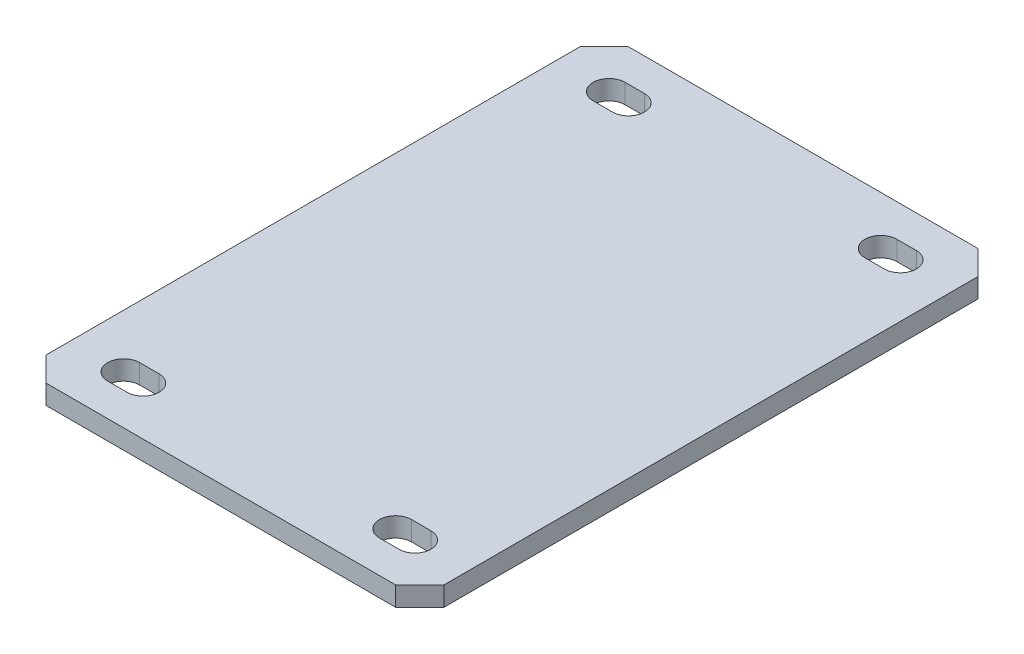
ISO-10303-21;
HEADER;
FILE_DESCRIPTION(('STEP AP214'),'2;1');
FILE_NAME('part.step','',(''),(''),'','','');
FILE_SCHEMA(('AUTOMOTIVE_DESIGN { 1 0 10303 214 1 1 1 1 }'));
ENDSEC;
DATA;
#1=APPLICATION_CONTEXT('core data for automotive mechanical design processes');
#2=APPLICATION_PROTOCOL_DEFINITION('international standard','automotive_design',2000,#1);
#3=PRODUCT_CONTEXT('',#1,'mechanical');
#4=PRODUCT('Part','Part','',(#3));
#5=PRODUCT_RELATED_PRODUCT_CATEGORY('part','',(#4));
#6=PRODUCT_DEFINITION_FORMATION('','',#4);
#7=PRODUCT_DEFINITION_CONTEXT('part definition',#1,'design');
#8=PRODUCT_DEFINITION('design','',#6,#7);
#9=PRODUCT_DEFINITION_SHAPE('','',#8);
#10=(LENGTH_UNIT() NAMED_UNIT(*) SI_UNIT(.MILLI.,.METRE.));
#11=(NAMED_UNIT(*) PLANE_ANGLE_UNIT() SI_UNIT($,.RADIAN.));
#12=(NAMED_UNIT(*) SI_UNIT($,.STERADIAN.) SOLID_ANGLE_UNIT());
#13=UNCERTAINTY_MEASURE_WITH_UNIT(LENGTH_MEASURE(1.E-05),#10,'distance_accuracy_value','');
#14=(GEOMETRIC_REPRESENTATION_CONTEXT(3) GLOBAL_UNCERTAINTY_ASSIGNED_CONTEXT((#13)) GLOBAL_UNIT_ASSIGNED_CONTEXT((#10,
#11,#12)) REPRESENTATION_CONTEXT('',''));
#15=CARTESIAN_POINT('',(0.,0.,0.));
#16=DIRECTION('',(0.,0.,1.));
#17=DIRECTION('',(1.,0.,0.));
#18=AXIS2_PLACEMENT_3D('',#15,#16,#17);
#19=CARTESIAN_POINT('',(-75.,4.,-60.));
#20=DIRECTION('',(0.,0.,1.));
#21=DIRECTION('',(1.,0.,0.));
#22=AXIS2_PLACEMENT_3D('',#19,#20,#21);
#23=PLANE('',#22);
#24=DIRECTION('',(-1.,0.,0.));
#25=VECTOR('',#24,1.);
#26=CARTESIAN_POINT('',(-75.,4.,-60.));
#27=LINE('',#26,#25);
#28=CARTESIAN_POINT('',(9.00000000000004,4.,-60.));
#29=VERTEX_POINT('',#28);
#30=CARTESIAN_POINT('',(-63.,4.,-60.));
#31=VERTEX_POINT('',#30);
#32=EDGE_CURVE('E342',#29,#31,#27,.T.);
#33=ORIENTED_EDGE('',*,*,#32,.F.);
#34=DIRECTION('',(0.,-1.,0.));
#35=VECTOR('',#34,1.);
#36=CARTESIAN_POINT('',(9.00000000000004,4.,-60.));
#37=LINE('',#36,#35);
#38=CARTESIAN_POINT('',(9.00000000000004,0.,-60.));
#39=VERTEX_POINT('',#38);
#40=EDGE_CURVE('E355',#29,#39,#37,.T.);
#41=ORIENTED_EDGE('',*,*,#40,.T.);
#42=DIRECTION('',(-1.,0.,0.));
#43=VECTOR('',#42,1.);
#44=CARTESIAN_POINT('',(-75.,0.,-60.));
#45=LINE('',#44,#43);
#46=CARTESIAN_POINT('',(-63.,0.,-60.));
#47=VERTEX_POINT('',#46);
#48=EDGE_CURVE('E335',#39,#47,#45,.T.);
#49=ORIENTED_EDGE('',*,*,#48,.T.);
#50=DIRECTION('',(0.,1.,0.));
#51=VECTOR('',#50,1.);
#52=CARTESIAN_POINT('',(-63.,4.,-60.));
#53=LINE('',#52,#51);
#54=EDGE_CURVE('E348',#47,#31,#53,.T.);
#55=ORIENTED_EDGE('',*,*,#54,.T.);
#56=EDGE_LOOP('',(#33,#41,#49,#55));
#57=FACE_BOUND('',#56,.T.);
#58=ADVANCED_FACE('F36',(#57),#23,.F.);
#59=CARTESIAN_POINT('',(-75.,4.,60.));
#60=DIRECTION('',(0.,0.,-1.));
#61=DIRECTION('',(-1.,0.,0.));
#62=AXIS2_PLACEMENT_3D('',#59,#60,#61);
#63=PLANE('',#62);
#64=DIRECTION('',(1.,0.,0.));
#65=VECTOR('',#64,1.);
#66=CARTESIAN_POINT('',(-75.,0.,60.));
#67=LINE('',#66,#65);
#68=CARTESIAN_POINT('',(-63.,0.,60.));
#69=VERTEX_POINT('',#68);
#70=CARTESIAN_POINT('',(9.00000000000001,0.,60.));
#71=VERTEX_POINT('',#70);
#72=EDGE_CURVE('E345',#69,#71,#67,.T.);
#73=ORIENTED_EDGE('',*,*,#72,.T.);
#74=DIRECTION('',(0.,1.,0.));
#75=VECTOR('',#74,1.);
#76=CARTESIAN_POINT('',(9.00000000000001,4.,60.));
#77=LINE('',#76,#75);
#78=CARTESIAN_POINT('',(9.00000000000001,4.,60.));
#79=VERTEX_POINT('',#78);
#80=EDGE_CURVE('E379',#71,#79,#77,.T.);
#81=ORIENTED_EDGE('',*,*,#80,.T.);
#82=DIRECTION('',(1.,0.,0.));
#83=VECTOR('',#82,1.);
#84=CARTESIAN_POINT('',(-75.,4.,60.));
#85=LINE('',#84,#83);
#86=CARTESIAN_POINT('',(-63.,4.,60.));
#87=VERTEX_POINT('',#86);
#88=EDGE_CURVE('E344',#87,#79,#85,.T.);
#89=ORIENTED_EDGE('',*,*,#88,.F.);
#90=DIRECTION('',(0.,-1.,0.));
#91=VECTOR('',#90,1.);
#92=CARTESIAN_POINT('',(-63.,4.,60.));
#93=LINE('',#92,#91);
#94=EDGE_CURVE('E377',#87,#69,#93,.T.);
#95=ORIENTED_EDGE('',*,*,#94,.T.);
#96=EDGE_LOOP('',(#73,#81,#89,#95));
#97=FACE_BOUND('',#96,.T.);
#98=ADVANCED_FACE('F414',(#97),#63,.F.);
#99=CARTESIAN_POINT('',(0.,4.,0.));
#100=DIRECTION('',(0.,-1.,0.));
#101=DIRECTION('',(0.,0.,-1.));
#102=AXIS2_PLACEMENT_3D('',#99,#100,#101);
#103=PLANE('',#102);
#104=DIRECTION('',(1.,0.,0.));
#105=VECTOR('',#104,1.);
#106=CARTESIAN_POINT('',(-57.,4.,53.3));
#107=LINE('',#106,#105);
#108=CARTESIAN_POINT('',(-57.,4.,53.3));
#109=VERTEX_POINT('',#108);
#110=CARTESIAN_POINT('',(-53.,4.,53.3));
#111=VERTEX_POINT('',#110);
#112=EDGE_CURVE('E235',#109,#111,#107,.T.);
#113=ORIENTED_EDGE('',*,*,#112,.F.);
#114=CARTESIAN_POINT('',(-57.,4.,50.));
#115=DIRECTION('',(0.,1.,0.));
#116=DIRECTION('',(0.,0.,1.));
#117=AXIS2_PLACEMENT_3D('',#114,#115,#116);
#118=CIRCLE('',#117,3.3);
#119=CARTESIAN_POINT('',(-57.,4.,46.7));
#120=VERTEX_POINT('',#119);
#121=EDGE_CURVE('E205',#120,#109,#118,.T.);
#122=ORIENTED_EDGE('',*,*,#121,.F.);
#123=DIRECTION('',(-1.,0.,0.));
#124=VECTOR('',#123,1.);
#125=CARTESIAN_POINT('',(-57.,4.,46.7));
#126=LINE('',#125,#124);
#127=CARTESIAN_POINT('',(-53.,4.,46.7));
#128=VERTEX_POINT('',#127);
#129=EDGE_CURVE('E223',#128,#120,#126,.T.);
#130=ORIENTED_EDGE('',*,*,#129,.F.);
#131=CARTESIAN_POINT('',(-53.,4.,50.));
#132=DIRECTION('',(0.,1.,0.));
#133=DIRECTION('',(0.,0.,1.));
#134=AXIS2_PLACEMENT_3D('',#131,#132,#133);
#135=CIRCLE('',#134,3.3);
#136=EDGE_CURVE('E226',#111,#128,#135,.T.);
#137=ORIENTED_EDGE('',*,*,#136,.F.);
#138=EDGE_LOOP('',(#113,#122,#130,#137));
#139=FACE_BOUND('',#138,.T.);
#140=DIRECTION('',(1.,0.,0.));
#141=VECTOR('',#140,1.);
#142=CARTESIAN_POINT('',(-0.999999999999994,4.,53.3));
#143=LINE('',#142,#141);
#144=CARTESIAN_POINT('',(-0.999999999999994,4.,53.3));
#145=VERTEX_POINT('',#144);
#146=CARTESIAN_POINT('',(3.00000000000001,4.,53.3));
#147=VERTEX_POINT('',#146);
#148=EDGE_CURVE('E262',#145,#147,#143,.T.);
#149=ORIENTED_EDGE('',*,*,#148,.F.);
#150=CARTESIAN_POINT('',(-0.999999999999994,4.,50.));
#151=DIRECTION('',(0.,1.,0.));
#152=DIRECTION('',(0.,0.,1.));
#153=AXIS2_PLACEMENT_3D('',#150,#151,#152);
#154=CIRCLE('',#153,3.3);
#155=CARTESIAN_POINT('',(-0.999999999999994,4.,46.7));
#156=VERTEX_POINT('',#155);
#157=EDGE_CURVE('E260',#156,#145,#154,.T.);
#158=ORIENTED_EDGE('',*,*,#157,.F.);
#159=DIRECTION('',(-1.,0.,0.));
#160=VECTOR('',#159,1.);
#161=CARTESIAN_POINT('',(-0.999999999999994,4.,46.7));
#162=LINE('',#161,#160);
#163=CARTESIAN_POINT('',(3.00000000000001,4.,46.7));
#164=VERTEX_POINT('',#163);
#165=EDGE_CURVE('E250',#164,#156,#162,.T.);
#166=ORIENTED_EDGE('',*,*,#165,.F.);
#167=CARTESIAN_POINT('',(3.00000000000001,4.,50.));
#168=DIRECTION('',(0.,1.,0.));
#169=DIRECTION('',(0.,0.,1.));
#170=AXIS2_PLACEMENT_3D('',#167,#168,#169);
#171=CIRCLE('',#170,3.3);
#172=EDGE_CURVE('E266',#147,#164,#171,.T.);
#173=ORIENTED_EDGE('',*,*,#172,.F.);
#174=EDGE_LOOP('',(#149,#158,#166,#173));
#175=FACE_BOUND('',#174,.T.);
#176=DIRECTION('',(1.,0.,0.));
#177=VECTOR('',#176,1.);
#178=CARTESIAN_POINT('',(-0.999999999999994,4.,-46.7));
#179=LINE('',#178,#177);
#180=CARTESIAN_POINT('',(-0.999999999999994,4.,-46.7));
#181=VERTEX_POINT('',#180);
#182=CARTESIAN_POINT('',(3.00000000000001,4.,-46.7));
#183=VERTEX_POINT('',#182);
#184=EDGE_CURVE('E294',#181,#183,#179,.T.);
#185=ORIENTED_EDGE('',*,*,#184,.F.);
#186=CARTESIAN_POINT('',(-0.999999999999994,4.,-50.));
#187=DIRECTION('',(0.,1.,0.));
#188=DIRECTION('',(0.,0.,1.));
#189=AXIS2_PLACEMENT_3D('',#186,#187,#188);
#190=CIRCLE('',#189,3.3);
#191=CARTESIAN_POINT('',(-0.999999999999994,4.,-53.3));
#192=VERTEX_POINT('',#191);
#193=EDGE_CURVE('E292',#192,#181,#190,.T.);
#194=ORIENTED_EDGE('',*,*,#193,.F.);
#195=DIRECTION('',(-1.,0.,0.));
#196=VECTOR('',#195,1.);
#197=CARTESIAN_POINT('',(-0.999999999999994,4.,-53.3));
#198=LINE('',#197,#196);
#199=CARTESIAN_POINT('',(3.00000000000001,4.,-53.3));
#200=VERTEX_POINT('',#199);
#201=EDGE_CURVE('E282',#200,#192,#198,.T.);
#202=ORIENTED_EDGE('',*,*,#201,.F.);
#203=CARTESIAN_POINT('',(3.00000000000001,4.,-50.));
#204=DIRECTION('',(0.,1.,0.));
#205=DIRECTION('',(0.,0.,1.));
#206=AXIS2_PLACEMENT_3D('',#203,#204,#205);
#207=CIRCLE('',#206,3.3);
#208=EDGE_CURVE('E298',#183,#200,#207,.T.);
#209=ORIENTED_EDGE('',*,*,#208,.F.);
#210=EDGE_LOOP('',(#185,#194,#202,#209));
#211=FACE_BOUND('',#210,.T.);
#212=DIRECTION('',(1.,0.,0.));
#213=VECTOR('',#212,1.);
#214=CARTESIAN_POINT('',(-57.,4.,-46.7));
#215=LINE('',#214,#213);
#216=CARTESIAN_POINT('',(-57.,4.,-46.7));
#217=VERTEX_POINT('',#216);
#218=CARTESIAN_POINT('',(-53.,4.,-46.7));
#219=VERTEX_POINT('',#218);
#220=EDGE_CURVE('E325',#217,#219,#215,.T.);
#221=ORIENTED_EDGE('',*,*,#220,.F.);
#222=CARTESIAN_POINT('',(-57.,4.,-50.));
#223=DIRECTION('',(0.,1.,0.));
#224=DIRECTION('',(0.,0.,1.));
#225=AXIS2_PLACEMENT_3D('',#222,#223,#224);
#226=CIRCLE('',#225,3.3);
#227=CARTESIAN_POINT('',(-57.,4.,-53.3));
#228=VERTEX_POINT('',#227);
#229=EDGE_CURVE('E242',#228,#217,#226,.T.);
#230=ORIENTED_EDGE('',*,*,#229,.F.);
#231=DIRECTION('',(-1.,0.,0.));
#232=VECTOR('',#231,1.);
#233=CARTESIAN_POINT('',(-57.,4.,-53.3));
#234=LINE('',#233,#232);
#235=CARTESIAN_POINT('',(-53.,4.,-53.3));
#236=VERTEX_POINT('',#235);
#237=EDGE_CURVE('E314',#236,#228,#234,.T.);
#238=ORIENTED_EDGE('',*,*,#237,.F.);
#239=CARTESIAN_POINT('',(-53.,4.,-50.));
#240=DIRECTION('',(0.,1.,0.));
#241=DIRECTION('',(0.,0.,1.));
#242=AXIS2_PLACEMENT_3D('',#239,#240,#241);
#243=CIRCLE('',#242,3.3);
#244=EDGE_CURVE('E328',#219,#236,#243,.T.);
#245=ORIENTED_EDGE('',*,*,#244,.F.);
#246=EDGE_LOOP('',(#221,#230,#238,#245));
#247=FACE_BOUND('',#246,.T.);
#248=DIRECTION('',(0.,0.,-1.));
#249=VECTOR('',#248,1.);
#250=CARTESIAN_POINT('',(14.,4.,60.));
#251=LINE('',#250,#249);
#252=CARTESIAN_POINT('',(14.,4.,55.));
#253=VERTEX_POINT('',#252);
#254=CARTESIAN_POINT('',(14.,4.,-55.));
#255=VERTEX_POINT('',#254);
#256=EDGE_CURVE('E389',#253,#255,#251,.T.);
#257=ORIENTED_EDGE('',*,*,#256,.T.);
#258=DIRECTION('',(0.707106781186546,0.,0.707106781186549));
#259=VECTOR('',#258,1.);
#260=CARTESIAN_POINT('',(9.00000000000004,4.,-60.));
#261=LINE('',#260,#259);
#262=EDGE_CURVE('E375',#255,#29,#261,.F.);
#263=ORIENTED_EDGE('',*,*,#262,.T.);
#264=ORIENTED_EDGE('',*,*,#32,.T.);
#265=DIRECTION('',(0.707106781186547,0.,-0.707106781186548));
#266=VECTOR('',#265,1.);
#267=CARTESIAN_POINT('',(-63.,4.,-60.));
#268=LINE('',#267,#266);
#269=CARTESIAN_POINT('',(-68.,4.,-55.));
#270=VERTEX_POINT('',#269);
#271=EDGE_CURVE('E51',#31,#270,#268,.F.);
#272=ORIENTED_EDGE('',*,*,#271,.T.);
#273=DIRECTION('',(0.,0.,-1.));
#274=VECTOR('',#273,1.);
#275=CARTESIAN_POINT('',(-68.,4.,-60.));
#276=LINE('',#275,#274);
#277=CARTESIAN_POINT('',(-68.,4.,55.));
#278=VERTEX_POINT('',#277);
#279=EDGE_CURVE('E229',#278,#270,#276,.T.);
#280=ORIENTED_EDGE('',*,*,#279,.F.);
#281=DIRECTION('',(-0.70710678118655,0.,-0.707106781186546));
#282=VECTOR('',#281,1.);
#283=CARTESIAN_POINT('',(-68.,4.,55.));
#284=LINE('',#283,#282);
#285=EDGE_CURVE('E59',#278,#87,#284,.F.);
#286=ORIENTED_EDGE('',*,*,#285,.T.);
#287=ORIENTED_EDGE('',*,*,#88,.T.);
#288=DIRECTION('',(-0.70710678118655,0.,0.707106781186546));
#289=VECTOR('',#288,1.);
#290=CARTESIAN_POINT('',(14.,4.,55.));
#291=LINE('',#290,#289);
#292=EDGE_CURVE('E373',#79,#253,#291,.F.);
#293=ORIENTED_EDGE('',*,*,#292,.T.);
#294=EDGE_LOOP('',(#257,#263,#264,#272,#280,#286,#287,#293));
#295=FACE_BOUND('',#294,.T.);
#296=ADVANCED_FACE('F387',(#139,#175,#211,#247,#295),#103,.F.);
#297=CARTESIAN_POINT('',(0.,0.,0.));
#298=DIRECTION('',(0.,-1.,0.));
#299=DIRECTION('',(0.,0.,-1.));
#300=AXIS2_PLACEMENT_3D('',#297,#298,#299);
#301=PLANE('',#300);
#302=ORIENTED_EDGE('',*,*,#48,.F.);
#303=DIRECTION('',(-0.707106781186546,0.,-0.707106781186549));
#304=VECTOR('',#303,1.);
#305=CARTESIAN_POINT('',(34.5,0.,-34.4999999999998));
#306=LINE('',#305,#304);
#307=CARTESIAN_POINT('',(14.,0.,-55.));
#308=VERTEX_POINT('',#307);
#309=EDGE_CURVE('E364',#39,#308,#306,.F.);
#310=ORIENTED_EDGE('',*,*,#309,.T.);
#311=DIRECTION('',(0.,0.,-1.));
#312=VECTOR('',#311,1.);
#313=CARTESIAN_POINT('',(14.,0.,60.));
#314=LINE('',#313,#312);
#315=CARTESIAN_POINT('',(14.,0.,55.));
#316=VERTEX_POINT('',#315);
#317=EDGE_CURVE('E390',#316,#308,#314,.T.);
#318=ORIENTED_EDGE('',*,*,#317,.F.);
#319=DIRECTION('',(0.70710678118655,0.,-0.707106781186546));
#320=VECTOR('',#319,1.);
#321=CARTESIAN_POINT('',(34.5,0.,34.5000000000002));
#322=LINE('',#321,#320);
#323=EDGE_CURVE('E362',#316,#71,#322,.F.);
#324=ORIENTED_EDGE('',*,*,#323,.T.);
#325=ORIENTED_EDGE('',*,*,#72,.F.);
#326=DIRECTION('',(0.70710678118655,0.,0.707106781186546));
#327=VECTOR('',#326,1.);
#328=CARTESIAN_POINT('',(-61.4999999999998,0.,61.5000000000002));
#329=LINE('',#328,#327);
#330=CARTESIAN_POINT('',(-68.,0.,55.));
#331=VERTEX_POINT('',#330);
#332=EDGE_CURVE('E358',#69,#331,#329,.F.);
#333=ORIENTED_EDGE('',*,*,#332,.T.);
#334=DIRECTION('',(0.,0.,-1.));
#335=VECTOR('',#334,1.);
#336=CARTESIAN_POINT('',(-68.,0.,-60.));
#337=LINE('',#336,#335);
#338=CARTESIAN_POINT('',(-68.,0.,-55.));
#339=VERTEX_POINT('',#338);
#340=EDGE_CURVE('E295',#331,#339,#337,.T.);
#341=ORIENTED_EDGE('',*,*,#340,.T.);
#342=DIRECTION('',(-0.707106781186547,0.,0.707106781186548));
#343=VECTOR('',#342,1.);
#344=CARTESIAN_POINT('',(-61.5000000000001,0.,-61.4999999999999));
#345=LINE('',#344,#343);
#346=EDGE_CURVE('E360',#339,#47,#345,.F.);
#347=ORIENTED_EDGE('',*,*,#346,.T.);
#348=EDGE_LOOP('',(#302,#310,#318,#324,#325,#333,#341,#347));
#349=FACE_BOUND('',#348,.T.);
#350=CARTESIAN_POINT('',(-57.,0.,50.));
#351=DIRECTION('',(0.,1.,0.));
#352=DIRECTION('',(0.,0.,1.));
#353=AXIS2_PLACEMENT_3D('',#350,#351,#352);
#354=CIRCLE('',#353,3.3);
#355=CARTESIAN_POINT('',(-57.,0.,46.7));
#356=VERTEX_POINT('',#355);
#357=CARTESIAN_POINT('',(-57.,0.,53.3));
#358=VERTEX_POINT('',#357);
#359=EDGE_CURVE('E202',#356,#358,#354,.T.);
#360=ORIENTED_EDGE('',*,*,#359,.T.);
#361=DIRECTION('',(1.,0.,0.));
#362=VECTOR('',#361,1.);
#363=CARTESIAN_POINT('',(-57.,0.,53.3));
#364=LINE('',#363,#362);
#365=CARTESIAN_POINT('',(-53.,0.,53.3));
#366=VERTEX_POINT('',#365);
#367=EDGE_CURVE('E214',#358,#366,#364,.T.);
#368=ORIENTED_EDGE('',*,*,#367,.T.);
#369=CARTESIAN_POINT('',(-53.,0.,50.));
#370=DIRECTION('',(0.,1.,0.));
#371=DIRECTION('',(0.,0.,1.));
#372=AXIS2_PLACEMENT_3D('',#369,#370,#371);
#373=CIRCLE('',#372,3.3);
#374=CARTESIAN_POINT('',(-53.,0.,46.7));
#375=VERTEX_POINT('',#374);
#376=EDGE_CURVE('E218',#366,#375,#373,.T.);
#377=ORIENTED_EDGE('',*,*,#376,.T.);
#378=DIRECTION('',(-1.,0.,0.));
#379=VECTOR('',#378,1.);
#380=CARTESIAN_POINT('',(-57.,0.,46.7));
#381=LINE('',#380,#379);
#382=EDGE_CURVE('E210',#375,#356,#381,.T.);
#383=ORIENTED_EDGE('',*,*,#382,.T.);
#384=EDGE_LOOP('',(#360,#368,#377,#383));
#385=FACE_BOUND('',#384,.T.);
#386=CARTESIAN_POINT('',(-0.999999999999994,0.,50.));
#387=DIRECTION('',(0.,1.,0.));
#388=DIRECTION('',(0.,0.,1.));
#389=AXIS2_PLACEMENT_3D('',#386,#387,#388);
#390=CIRCLE('',#389,3.3);
#391=CARTESIAN_POINT('',(-0.999999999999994,0.,46.7));
#392=VERTEX_POINT('',#391);
#393=CARTESIAN_POINT('',(-0.999999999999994,0.,53.3));
#394=VERTEX_POINT('',#393);
#395=EDGE_CURVE('E246',#392,#394,#390,.T.);
#396=ORIENTED_EDGE('',*,*,#395,.T.);
#397=DIRECTION('',(1.,0.,0.));
#398=VECTOR('',#397,1.);
#399=CARTESIAN_POINT('',(-0.999999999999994,0.,53.3));
#400=LINE('',#399,#398);
#401=CARTESIAN_POINT('',(3.00000000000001,0.,53.3));
#402=VERTEX_POINT('',#401);
#403=EDGE_CURVE('E249',#394,#402,#400,.T.);
#404=ORIENTED_EDGE('',*,*,#403,.T.);
#405=CARTESIAN_POINT('',(3.00000000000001,0.,50.));
#406=DIRECTION('',(0.,1.,0.));
#407=DIRECTION('',(0.,0.,1.));
#408=AXIS2_PLACEMENT_3D('',#405,#406,#407);
#409=CIRCLE('',#408,3.3);
#410=CARTESIAN_POINT('',(3.00000000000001,0.,46.7));
#411=VERTEX_POINT('',#410);
#412=EDGE_CURVE('E253',#402,#411,#409,.T.);
#413=ORIENTED_EDGE('',*,*,#412,.T.);
#414=DIRECTION('',(-1.,0.,0.));
#415=VECTOR('',#414,1.);
#416=CARTESIAN_POINT('',(-0.999999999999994,0.,46.7));
#417=LINE('',#416,#415);
#418=EDGE_CURVE('E256',#411,#392,#417,.T.);
#419=ORIENTED_EDGE('',*,*,#418,.T.);
#420=EDGE_LOOP('',(#396,#404,#413,#419));
#421=FACE_BOUND('',#420,.T.);
#422=CARTESIAN_POINT('',(-0.999999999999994,0.,-50.));
#423=DIRECTION('',(0.,1.,0.));
#424=DIRECTION('',(0.,0.,1.));
#425=AXIS2_PLACEMENT_3D('',#422,#423,#424);
#426=CIRCLE('',#425,3.3);
#427=CARTESIAN_POINT('',(-0.999999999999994,0.,-53.3));
#428=VERTEX_POINT('',#427);
#429=CARTESIAN_POINT('',(-0.999999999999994,0.,-46.7));
#430=VERTEX_POINT('',#429);
#431=EDGE_CURVE('E278',#428,#430,#426,.T.);
#432=ORIENTED_EDGE('',*,*,#431,.T.);
#433=DIRECTION('',(1.,0.,0.));
#434=VECTOR('',#433,1.);
#435=CARTESIAN_POINT('',(-0.999999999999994,0.,-46.7));
#436=LINE('',#435,#434);
#437=CARTESIAN_POINT('',(3.00000000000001,0.,-46.7));
#438=VERTEX_POINT('',#437);
#439=EDGE_CURVE('E281',#430,#438,#436,.T.);
#440=ORIENTED_EDGE('',*,*,#439,.T.);
#441=CARTESIAN_POINT('',(3.00000000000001,0.,-50.));
#442=DIRECTION('',(0.,1.,0.));
#443=DIRECTION('',(0.,0.,1.));
#444=AXIS2_PLACEMENT_3D('',#441,#442,#443);
#445=CIRCLE('',#444,3.3);
#446=CARTESIAN_POINT('',(3.00000000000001,0.,-53.3));
#447=VERTEX_POINT('',#446);
#448=EDGE_CURVE('E285',#438,#447,#445,.T.);
#449=ORIENTED_EDGE('',*,*,#448,.T.);
#450=DIRECTION('',(-1.,0.,0.));
#451=VECTOR('',#450,1.);
#452=CARTESIAN_POINT('',(-0.999999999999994,0.,-53.3));
#453=LINE('',#452,#451);
#454=EDGE_CURVE('E288',#447,#428,#453,.T.);
#455=ORIENTED_EDGE('',*,*,#454,.T.);
#456=EDGE_LOOP('',(#432,#440,#449,#455));
#457=FACE_BOUND('',#456,.T.);
#458=CARTESIAN_POINT('',(-57.,0.,-50.));
#459=DIRECTION('',(0.,1.,0.));
#460=DIRECTION('',(0.,0.,1.));
#461=AXIS2_PLACEMENT_3D('',#458,#459,#460);
#462=CIRCLE('',#461,3.3);
#463=CARTESIAN_POINT('',(-57.,0.,-53.3));
#464=VERTEX_POINT('',#463);
#465=CARTESIAN_POINT('',(-57.,0.,-46.7));
#466=VERTEX_POINT('',#465);
#467=EDGE_CURVE('E310',#464,#466,#462,.T.);
#468=ORIENTED_EDGE('',*,*,#467,.T.);
#469=DIRECTION('',(1.,0.,0.));
#470=VECTOR('',#469,1.);
#471=CARTESIAN_POINT('',(-57.,0.,-46.7));
#472=LINE('',#471,#470);
#473=CARTESIAN_POINT('',(-53.,0.,-46.7));
#474=VERTEX_POINT('',#473);
#475=EDGE_CURVE('E313',#466,#474,#472,.T.);
#476=ORIENTED_EDGE('',*,*,#475,.T.);
#477=CARTESIAN_POINT('',(-53.,0.,-50.));
#478=DIRECTION('',(0.,1.,0.));
#479=DIRECTION('',(0.,0.,1.));
#480=AXIS2_PLACEMENT_3D('',#477,#478,#479);
#481=CIRCLE('',#480,3.3);
#482=CARTESIAN_POINT('',(-53.,0.,-53.3));
#483=VERTEX_POINT('',#482);
#484=EDGE_CURVE('E317',#474,#483,#481,.T.);
#485=ORIENTED_EDGE('',*,*,#484,.T.);
#486=DIRECTION('',(-1.,0.,0.));
#487=VECTOR('',#486,1.);
#488=CARTESIAN_POINT('',(-57.,0.,-53.3));
#489=LINE('',#488,#487);
#490=EDGE_CURVE('E320',#483,#464,#489,.T.);
#491=ORIENTED_EDGE('',*,*,#490,.T.);
#492=EDGE_LOOP('',(#468,#476,#485,#491));
#493=FACE_BOUND('',#492,.T.);
#494=ADVANCED_FACE('F220',(#349,#385,#421,#457,#493),#301,.T.);
#495=CARTESIAN_POINT('',(-57.,0.,-50.));
#496=DIRECTION('',(0.,1.,0.));
#497=DIRECTION('',(0.,0.,1.));
#498=AXIS2_PLACEMENT_3D('',#495,#496,#497);
#499=CYLINDRICAL_SURFACE('',#498,3.3);
#500=ORIENTED_EDGE('',*,*,#229,.T.);
#501=DIRECTION('',(0.,1.,0.));
#502=VECTOR('',#501,1.);
#503=CARTESIAN_POINT('',(-57.,0.,-46.7));
#504=LINE('',#503,#502);
#505=EDGE_CURVE('E323',#466,#217,#504,.T.);
#506=ORIENTED_EDGE('',*,*,#505,.F.);
#507=ORIENTED_EDGE('',*,*,#467,.F.);
#508=DIRECTION('',(0.,1.,0.));
#509=VECTOR('',#508,1.);
#510=CARTESIAN_POINT('',(-57.,0.,-53.3));
#511=LINE('',#510,#509);
#512=EDGE_CURVE('E333',#464,#228,#511,.T.);
#513=ORIENTED_EDGE('',*,*,#512,.T.);
#514=EDGE_LOOP('',(#500,#506,#507,#513));
#515=FACE_BOUND('',#514,.T.);
#516=ADVANCED_FACE('F435',(#515),#499,.F.);
#517=CARTESIAN_POINT('',(-57.,0.,-53.3));
#518=DIRECTION('',(0.,0.,-1.));
#519=DIRECTION('',(-1.,0.,0.));
#520=AXIS2_PLACEMENT_3D('',#517,#518,#519);
#521=PLANE('',#520);
#522=ORIENTED_EDGE('',*,*,#237,.T.);
#523=ORIENTED_EDGE('',*,*,#512,.F.);
#524=ORIENTED_EDGE('',*,*,#490,.F.);
#525=DIRECTION('',(0.,1.,0.));
#526=VECTOR('',#525,1.);
#527=CARTESIAN_POINT('',(-53.,0.,-53.3));
#528=LINE('',#527,#526);
#529=EDGE_CURVE('E336',#483,#236,#528,.T.);
#530=ORIENTED_EDGE('',*,*,#529,.T.);
#531=EDGE_LOOP('',(#522,#523,#524,#530));
#532=FACE_BOUND('',#531,.T.);
#533=ADVANCED_FACE('F441',(#532),#521,.F.);
#534=CARTESIAN_POINT('',(-53.,0.,-50.));
#535=DIRECTION('',(0.,1.,0.));
#536=DIRECTION('',(0.,0.,1.));
#537=AXIS2_PLACEMENT_3D('',#534,#535,#536);
#538=CYLINDRICAL_SURFACE('',#537,3.3);
#539=ORIENTED_EDGE('',*,*,#244,.T.);
#540=ORIENTED_EDGE('',*,*,#529,.F.);
#541=ORIENTED_EDGE('',*,*,#484,.F.);
#542=DIRECTION('',(0.,1.,0.));
#543=VECTOR('',#542,1.);
#544=CARTESIAN_POINT('',(-53.,0.,-46.7));
#545=LINE('',#544,#543);
#546=EDGE_CURVE('E338',#474,#219,#545,.T.);
#547=ORIENTED_EDGE('',*,*,#546,.T.);
#548=EDGE_LOOP('',(#539,#540,#541,#547));
#549=FACE_BOUND('',#548,.T.);
#550=ADVANCED_FACE('F447',(#549),#538,.F.);
#551=CARTESIAN_POINT('',(-57.,0.,-46.7));
#552=DIRECTION('',(0.,0.,1.));
#553=DIRECTION('',(1.,0.,0.));
#554=AXIS2_PLACEMENT_3D('',#551,#552,#553);
#555=PLANE('',#554);
#556=ORIENTED_EDGE('',*,*,#220,.T.);
#557=ORIENTED_EDGE('',*,*,#546,.F.);
#558=ORIENTED_EDGE('',*,*,#475,.F.);
#559=ORIENTED_EDGE('',*,*,#505,.T.);
#560=EDGE_LOOP('',(#556,#557,#558,#559));
#561=FACE_BOUND('',#560,.T.);
#562=ADVANCED_FACE('F443',(#561),#555,.F.);
#563=CARTESIAN_POINT('',(-0.999999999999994,0.,-50.));
#564=DIRECTION('',(0.,1.,0.));
#565=DIRECTION('',(0.,0.,1.));
#566=AXIS2_PLACEMENT_3D('',#563,#564,#565);
#567=CYLINDRICAL_SURFACE('',#566,3.3);
#568=ORIENTED_EDGE('',*,*,#193,.T.);
#569=DIRECTION('',(0.,1.,0.));
#570=VECTOR('',#569,1.);
#571=CARTESIAN_POINT('',(-0.999999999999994,0.,-46.7));
#572=LINE('',#571,#570);
#573=EDGE_CURVE('E291',#430,#181,#572,.T.);
#574=ORIENTED_EDGE('',*,*,#573,.F.);
#575=ORIENTED_EDGE('',*,*,#431,.F.);
#576=DIRECTION('',(0.,1.,0.));
#577=VECTOR('',#576,1.);
#578=CARTESIAN_POINT('',(-0.999999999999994,0.,-53.3));
#579=LINE('',#578,#577);
#580=EDGE_CURVE('E263',#428,#192,#579,.T.);
#581=ORIENTED_EDGE('',*,*,#580,.T.);
#582=EDGE_LOOP('',(#568,#574,#575,#581));
#583=FACE_BOUND('',#582,.T.);
#584=ADVANCED_FACE('F446',(#583),#567,.F.);
#585=CARTESIAN_POINT('',(-0.999999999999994,0.,-53.3));
#586=DIRECTION('',(0.,0.,-1.));
#587=DIRECTION('',(-1.,0.,0.));
#588=AXIS2_PLACEMENT_3D('',#585,#586,#587);
#589=PLANE('',#588);
#590=ORIENTED_EDGE('',*,*,#201,.T.);
#591=ORIENTED_EDGE('',*,*,#580,.F.);
#592=ORIENTED_EDGE('',*,*,#454,.F.);
#593=DIRECTION('',(0.,1.,0.));
#594=VECTOR('',#593,1.);
#595=CARTESIAN_POINT('',(3.00000000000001,0.,-53.3));
#596=LINE('',#595,#594);
#597=EDGE_CURVE('E304',#447,#200,#596,.T.);
#598=ORIENTED_EDGE('',*,*,#597,.T.);
#599=EDGE_LOOP('',(#590,#591,#592,#598));
#600=FACE_BOUND('',#599,.T.);
#601=ADVANCED_FACE('F457',(#600),#589,.F.);
#602=CARTESIAN_POINT('',(3.00000000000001,0.,-50.));
#603=DIRECTION('',(0.,1.,0.));
#604=DIRECTION('',(0.,0.,1.));
#605=AXIS2_PLACEMENT_3D('',#602,#603,#604);
#606=CYLINDRICAL_SURFACE('',#605,3.3);
#607=ORIENTED_EDGE('',*,*,#208,.T.);
#608=ORIENTED_EDGE('',*,*,#597,.F.);
#609=ORIENTED_EDGE('',*,*,#448,.F.);
#610=DIRECTION('',(0.,1.,0.));
#611=VECTOR('',#610,1.);
#612=CARTESIAN_POINT('',(3.00000000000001,0.,-46.7));
#613=LINE('',#612,#611);
#614=EDGE_CURVE('E306',#438,#183,#613,.T.);
#615=ORIENTED_EDGE('',*,*,#614,.T.);
#616=EDGE_LOOP('',(#607,#608,#609,#615));
#617=FACE_BOUND('',#616,.T.);
#618=ADVANCED_FACE('F463',(#617),#606,.F.);
#619=CARTESIAN_POINT('',(-0.999999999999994,0.,-46.7));
#620=DIRECTION('',(0.,0.,1.));
#621=DIRECTION('',(1.,0.,0.));
#622=AXIS2_PLACEMENT_3D('',#619,#620,#621);
#623=PLANE('',#622);
#624=ORIENTED_EDGE('',*,*,#184,.T.);
#625=ORIENTED_EDGE('',*,*,#614,.F.);
#626=ORIENTED_EDGE('',*,*,#439,.F.);
#627=ORIENTED_EDGE('',*,*,#573,.T.);
#628=EDGE_LOOP('',(#624,#625,#626,#627));
#629=FACE_BOUND('',#628,.T.);
#630=ADVANCED_FACE('F459',(#629),#623,.F.);
#631=CARTESIAN_POINT('',(-0.999999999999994,0.,50.));
#632=DIRECTION('',(0.,1.,0.));
#633=DIRECTION('',(0.,0.,1.));
#634=AXIS2_PLACEMENT_3D('',#631,#632,#633);
#635=CYLINDRICAL_SURFACE('',#634,3.3);
#636=ORIENTED_EDGE('',*,*,#157,.T.);
#637=DIRECTION('',(0.,1.,0.));
#638=VECTOR('',#637,1.);
#639=CARTESIAN_POINT('',(-0.999999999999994,0.,53.3));
#640=LINE('',#639,#638);
#641=EDGE_CURVE('E259',#394,#145,#640,.T.);
#642=ORIENTED_EDGE('',*,*,#641,.F.);
#643=ORIENTED_EDGE('',*,*,#395,.F.);
#644=DIRECTION('',(0.,1.,0.));
#645=VECTOR('',#644,1.);
#646=CARTESIAN_POINT('',(-0.999999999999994,0.,46.7));
#647=LINE('',#646,#645);
#648=EDGE_CURVE('E236',#392,#156,#647,.T.);
#649=ORIENTED_EDGE('',*,*,#648,.T.);
#650=EDGE_LOOP('',(#636,#642,#643,#649));
#651=FACE_BOUND('',#650,.T.);
#652=ADVANCED_FACE('F462',(#651),#635,.F.);
#653=CARTESIAN_POINT('',(-0.999999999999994,0.,46.7));
#654=DIRECTION('',(0.,0.,-1.));
#655=DIRECTION('',(-1.,0.,0.));
#656=AXIS2_PLACEMENT_3D('',#653,#654,#655);
#657=PLANE('',#656);
#658=ORIENTED_EDGE('',*,*,#165,.T.);
#659=ORIENTED_EDGE('',*,*,#648,.F.);
#660=ORIENTED_EDGE('',*,*,#418,.F.);
#661=DIRECTION('',(0.,1.,0.));
#662=VECTOR('',#661,1.);
#663=CARTESIAN_POINT('',(3.00000000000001,0.,46.7));
#664=LINE('',#663,#662);
#665=EDGE_CURVE('E272',#411,#164,#664,.T.);
#666=ORIENTED_EDGE('',*,*,#665,.T.);
#667=EDGE_LOOP('',(#658,#659,#660,#666));
#668=FACE_BOUND('',#667,.T.);
#669=ADVANCED_FACE('F473',(#668),#657,.F.);
#670=CARTESIAN_POINT('',(3.00000000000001,0.,50.));
#671=DIRECTION('',(0.,1.,0.));
#672=DIRECTION('',(0.,0.,1.));
#673=AXIS2_PLACEMENT_3D('',#670,#671,#672);
#674=CYLINDRICAL_SURFACE('',#673,3.3);
#675=ORIENTED_EDGE('',*,*,#172,.T.);
#676=ORIENTED_EDGE('',*,*,#665,.F.);
#677=ORIENTED_EDGE('',*,*,#412,.F.);
#678=DIRECTION('',(0.,1.,0.));
#679=VECTOR('',#678,1.);
#680=CARTESIAN_POINT('',(3.00000000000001,0.,53.3));
#681=LINE('',#680,#679);
#682=EDGE_CURVE('E274',#402,#147,#681,.T.);
#683=ORIENTED_EDGE('',*,*,#682,.T.);
#684=EDGE_LOOP('',(#675,#676,#677,#683));
#685=FACE_BOUND('',#684,.T.);
#686=ADVANCED_FACE('F478',(#685),#674,.F.);
#687=CARTESIAN_POINT('',(-0.999999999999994,0.,53.3));
#688=DIRECTION('',(0.,0.,1.));
#689=DIRECTION('',(1.,0.,0.));
#690=AXIS2_PLACEMENT_3D('',#687,#688,#689);
#691=PLANE('',#690);
#692=ORIENTED_EDGE('',*,*,#148,.T.);
#693=ORIENTED_EDGE('',*,*,#682,.F.);
#694=ORIENTED_EDGE('',*,*,#403,.F.);
#695=ORIENTED_EDGE('',*,*,#641,.T.);
#696=EDGE_LOOP('',(#692,#693,#694,#695));
#697=FACE_BOUND('',#696,.T.);
#698=ADVANCED_FACE('F475',(#697),#691,.F.);
#699=CARTESIAN_POINT('',(-57.,0.,50.));
#700=DIRECTION('',(0.,1.,0.));
#701=DIRECTION('',(0.,0.,1.));
#702=AXIS2_PLACEMENT_3D('',#699,#700,#701);
#703=CYLINDRICAL_SURFACE('',#702,3.3);
#704=ORIENTED_EDGE('',*,*,#121,.T.);
#705=DIRECTION('',(0.,1.,0.));
#706=VECTOR('',#705,1.);
#707=CARTESIAN_POINT('',(-57.,0.,53.3));
#708=LINE('',#707,#706);
#709=EDGE_CURVE('E198',#358,#109,#708,.T.);
#710=ORIENTED_EDGE('',*,*,#709,.F.);
#711=ORIENTED_EDGE('',*,*,#359,.F.);
#712=DIRECTION('',(0.,1.,0.));
#713=VECTOR('',#712,1.);
#714=CARTESIAN_POINT('',(-57.,0.,46.7));
#715=LINE('',#714,#713);
#716=EDGE_CURVE('E240',#356,#120,#715,.T.);
#717=ORIENTED_EDGE('',*,*,#716,.T.);
#718=EDGE_LOOP('',(#704,#710,#711,#717));
#719=FACE_BOUND('',#718,.T.);
#720=ADVANCED_FACE('F200',(#719),#703,.F.);
#721=CARTESIAN_POINT('',(-57.,0.,46.7));
#722=DIRECTION('',(0.,0.,-1.));
#723=DIRECTION('',(-1.,0.,0.));
#724=AXIS2_PLACEMENT_3D('',#721,#722,#723);
#725=PLANE('',#724);
#726=ORIENTED_EDGE('',*,*,#129,.T.);
#727=ORIENTED_EDGE('',*,*,#716,.F.);
#728=ORIENTED_EDGE('',*,*,#382,.F.);
#729=DIRECTION('',(0.,1.,0.));
#730=VECTOR('',#729,1.);
#731=CARTESIAN_POINT('',(-53.,0.,46.7));
#732=LINE('',#731,#730);
#733=EDGE_CURVE('E243',#375,#128,#732,.T.);
#734=ORIENTED_EDGE('',*,*,#733,.T.);
#735=EDGE_LOOP('',(#726,#727,#728,#734));
#736=FACE_BOUND('',#735,.T.);
#737=ADVANCED_FACE('F488',(#736),#725,.F.);
#738=CARTESIAN_POINT('',(-53.,0.,50.));
#739=DIRECTION('',(0.,1.,0.));
#740=DIRECTION('',(0.,0.,1.));
#741=AXIS2_PLACEMENT_3D('',#738,#739,#740);
#742=CYLINDRICAL_SURFACE('',#741,3.3);
#743=ORIENTED_EDGE('',*,*,#136,.T.);
#744=ORIENTED_EDGE('',*,*,#733,.F.);
#745=ORIENTED_EDGE('',*,*,#376,.F.);
#746=DIRECTION('',(0.,1.,0.));
#747=VECTOR('',#746,1.);
#748=CARTESIAN_POINT('',(-53.,0.,53.3));
#749=LINE('',#748,#747);
#750=EDGE_CURVE('E209',#366,#111,#749,.T.);
#751=ORIENTED_EDGE('',*,*,#750,.T.);
#752=EDGE_LOOP('',(#743,#744,#745,#751));
#753=FACE_BOUND('',#752,.T.);
#754=ADVANCED_FACE('F491',(#753),#742,.F.);
#755=CARTESIAN_POINT('',(-57.,0.,53.3));
#756=DIRECTION('',(0.,0.,1.));
#757=DIRECTION('',(1.,0.,0.));
#758=AXIS2_PLACEMENT_3D('',#755,#756,#757);
#759=PLANE('',#758);
#760=ORIENTED_EDGE('',*,*,#112,.T.);
#761=ORIENTED_EDGE('',*,*,#750,.F.);
#762=ORIENTED_EDGE('',*,*,#367,.F.);
#763=ORIENTED_EDGE('',*,*,#709,.T.);
#764=EDGE_LOOP('',(#760,#761,#762,#763));
#765=FACE_BOUND('',#764,.T.);
#766=ADVANCED_FACE('F215',(#765),#759,.F.);
#767=CARTESIAN_POINT('',(-68.,0.,-60.));
#768=DIRECTION('',(1.,0.,0.));
#769=DIRECTION('',(0.,0.,-1.));
#770=AXIS2_PLACEMENT_3D('',#767,#768,#769);
#771=PLANE('',#770);
#772=ORIENTED_EDGE('',*,*,#279,.T.);
#773=DIRECTION('',(0.,-1.,0.));
#774=VECTOR('',#773,1.);
#775=CARTESIAN_POINT('',(-68.,0.,-55.));
#776=LINE('',#775,#774);
#777=EDGE_CURVE('E11',#270,#339,#776,.T.);
#778=ORIENTED_EDGE('',*,*,#777,.T.);
#779=ORIENTED_EDGE('',*,*,#340,.F.);
#780=DIRECTION('',(0.,1.,0.));
#781=VECTOR('',#780,1.);
#782=CARTESIAN_POINT('',(-68.,0.,55.));
#783=LINE('',#782,#781);
#784=EDGE_CURVE('E44',#331,#278,#783,.T.);
#785=ORIENTED_EDGE('',*,*,#784,.T.);
#786=EDGE_LOOP('',(#772,#778,#779,#785));
#787=FACE_BOUND('',#786,.T.);
#788=ADVANCED_FACE('F382',(#787),#771,.F.);
#789=CARTESIAN_POINT('',(14.,4.,60.));
#790=DIRECTION('',(-1.,0.,0.));
#791=DIRECTION('',(0.,0.,1.));
#792=AXIS2_PLACEMENT_3D('',#789,#790,#791);
#793=PLANE('',#792);
#794=ORIENTED_EDGE('',*,*,#317,.T.);
#795=DIRECTION('',(0.,1.,0.));
#796=VECTOR('',#795,1.);
#797=CARTESIAN_POINT('',(14.,4.,-55.));
#798=LINE('',#797,#796);
#799=EDGE_CURVE('E369',#308,#255,#798,.T.);
#800=ORIENTED_EDGE('',*,*,#799,.T.);
#801=ORIENTED_EDGE('',*,*,#256,.F.);
#802=DIRECTION('',(0.,-1.,0.));
#803=VECTOR('',#802,1.);
#804=CARTESIAN_POINT('',(14.,4.,55.));
#805=LINE('',#804,#803);
#806=EDGE_CURVE('E366',#253,#316,#805,.T.);
#807=ORIENTED_EDGE('',*,*,#806,.T.);
#808=EDGE_LOOP('',(#794,#800,#801,#807));
#809=FACE_BOUND('',#808,.T.);
#810=ADVANCED_FACE('F399',(#809),#793,.F.);
#811=CARTESIAN_POINT('',(9.00000000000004,4.,-60.));
#812=DIRECTION('',(-0.707106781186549,0.,0.707106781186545));
#813=DIRECTION('',(0.,-1.,0.));
#814=AXIS2_PLACEMENT_3D('',#811,#812,#813);
#815=PLANE('',#814);
#816=ORIENTED_EDGE('',*,*,#262,.F.);
#817=ORIENTED_EDGE('',*,*,#799,.F.);
#818=ORIENTED_EDGE('',*,*,#309,.F.);
#819=ORIENTED_EDGE('',*,*,#40,.F.);
#820=EDGE_LOOP('',(#816,#817,#818,#819));
#821=FACE_BOUND('',#820,.T.);
#822=ADVANCED_FACE('F403',(#821),#815,.F.);
#823=CARTESIAN_POINT('',(14.,4.,55.));
#824=DIRECTION('',(-0.707106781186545,0.,-0.707106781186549));
#825=DIRECTION('',(0.,-1.,0.));
#826=AXIS2_PLACEMENT_3D('',#823,#824,#825);
#827=PLANE('',#826);
#828=ORIENTED_EDGE('',*,*,#292,.F.);
#829=ORIENTED_EDGE('',*,*,#80,.F.);
#830=ORIENTED_EDGE('',*,*,#323,.F.);
#831=ORIENTED_EDGE('',*,*,#806,.F.);
#832=EDGE_LOOP('',(#828,#829,#830,#831));
#833=FACE_BOUND('',#832,.T.);
#834=ADVANCED_FACE('F418',(#833),#827,.F.);
#835=CARTESIAN_POINT('',(-63.,4.,-60.));
#836=DIRECTION('',(0.707106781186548,0.,0.707106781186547));
#837=DIRECTION('',(0.,1.,0.));
#838=AXIS2_PLACEMENT_3D('',#835,#836,#837);
#839=PLANE('',#838);
#840=ORIENTED_EDGE('',*,*,#346,.F.);
#841=ORIENTED_EDGE('',*,*,#777,.F.);
#842=ORIENTED_EDGE('',*,*,#271,.F.);
#843=ORIENTED_EDGE('',*,*,#54,.F.);
#844=EDGE_LOOP('',(#840,#841,#842,#843));
#845=FACE_BOUND('',#844,.T.);
#846=ADVANCED_FACE('F411',(#845),#839,.F.);
#847=CARTESIAN_POINT('',(-68.,0.,55.));
#848=DIRECTION('',(0.707106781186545,0.,-0.707106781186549));
#849=DIRECTION('',(0.,1.,0.));
#850=AXIS2_PLACEMENT_3D('',#847,#848,#849);
#851=PLANE('',#850);
#852=ORIENTED_EDGE('',*,*,#332,.F.);
#853=ORIENTED_EDGE('',*,*,#94,.F.);
#854=ORIENTED_EDGE('',*,*,#285,.F.);
#855=ORIENTED_EDGE('',*,*,#784,.F.);
#856=EDGE_LOOP('',(#852,#853,#854,#855));
#857=FACE_BOUND('',#856,.T.);
#858=ADVANCED_FACE('F38',(#857),#851,.F.);
#859=CLOSED_SHELL('',(#58,#98,#296,#494,#516,#533,#550,#562,#584,#601,#618,#630,#652,#669,#686,
#698,#720,#737,#754,#766,#788,#810,#822,#834,#846,#858));
#860=MANIFOLD_SOLID_BREP('B2',#859);
#861=ADVANCED_BREP_SHAPE_REPRESENTATION('',(#18,#860),#14);
#862=SHAPE_DEFINITION_REPRESENTATION(#9,#861);
ENDSEC;
END-ISO-10303-21;
